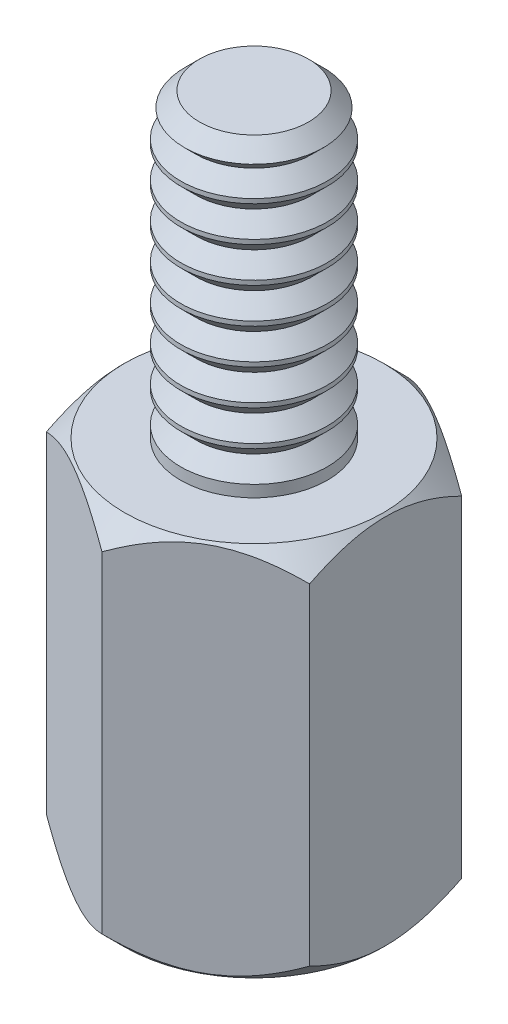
from build123d import *

# Parameters (mm, degrees)
BOSS_EXTRU_1_DEPTH      = 10
ESQUISSE3_R             = 1.95
BOSS_EXTRU_2_DEPTH      = 8
CHANFREIN1_SIZE         = 0.5
ESQUISSE5_R             = 1.95
ENL_V_MAT_EXTRU_1_DEPTH = 9


with BuildPart() as part:
    # Esquisse1 → Boss.-Extru.1 (new body)
    with BuildSketch(Plane(origin=(0, 0, 0), x_dir=(1, 0, 0), z_dir=(0, 1, 0))):
        Polygon((0, 4.041451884), (-3.5, 2.020725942), (-3.5, -2.020725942), (0, -4.041451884), (3.5, -2.020725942), (3.5, 2.020725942), align=None)
    extrude(amount=BOSS_EXTRU_1_DEPTH)

    # Esquisse2 → Enl_vement de mati_re-R_volution1 (revolve, cut)
    with BuildSketch(Plane(origin=(0, 0, 0), x_dir=(0, 0, -1), z_dir=(1, 0, 0)), mode=Mode.PRIVATE) as enl_vement_de_mati_re_r_volution1_sk:
        Polygon((-4.041451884, 9.4), (-3.441451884, 10), (-4.041451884, 10), align=None)
        Polygon((-4.041451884, 0), (-4.041451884, 0.6), (-3.441451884, 0), align=None)
    revolve(enl_vement_de_mati_re_r_volution1_sk.sketch.rotate(Axis((0, 10, 0), (0, -1, 0)), 180), axis=Axis((0, 10, 0), (0, -1, 0)), mode=Mode.SUBTRACT)

    # Esquisse3 → Boss.-Extru.2 (add)
    with BuildSketch(Plane(origin=(0, 10, 0), x_dir=(1, 0, 0), z_dir=(0, 1, 0))):
        with Locations(Location((0, 0, 0), (0, 0, 270))):
            Circle(ESQUISSE3_R)
    extrude(amount=BOSS_EXTRU_2_DEPTH)

    # Chanfrein1
    chanfrein1_edges = [part.edges().sort_by_distance(p)[0] for p in [
        (0, 18, -1.95),
    ]]
    chamfer(chanfrein1_edges, length=CHANFREIN1_SIZE)

    # Esquisse4 → Enl_vement de mati_re-R_volution2 (revolve, cut)
    with BuildSketch(Plane(origin=(0, 0, 0), x_dir=(0, 0, -1), z_dir=(1, 0, 0)), mode=Mode.PRIVATE) as enl_vement_de_mati_re_r_volution2_sk:
        Polygon((-1.95, 11.130243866), (-1.95, 10.31), (-1.539878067, 10.720121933), align=None)
        Polygon((-1.95, 12.070243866), (-1.95, 11.25), (-1.539878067, 11.660121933), align=None)
        Polygon((-1.95, 13.010243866), (-1.95, 12.19), (-1.539878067, 12.600121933), align=None)
        Polygon((-1.95, 13.950243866), (-1.95, 13.13), (-1.539878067, 13.540121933), align=None)
        Polygon((-1.95, 14.890243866), (-1.95, 14.07), (-1.539878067, 14.480121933), align=None)
        Polygon((-1.95, 15.830243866), (-1.95, 15.01), (-1.539878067, 15.420121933), align=None)
        Polygon((-1.95, 16.770243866), (-1.95, 15.95), (-1.539878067, 16.360121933), align=None)
        Polygon((-1.95, 17.710243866), (-1.95, 16.89), (-1.539878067, 17.300121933), align=None)
    revolve(enl_vement_de_mati_re_r_volution2_sk.sketch.rotate(Axis((0, 10, 0), (0, 1, 0)), 180), axis=Axis((0, 10, 0), (0, 1, 0)), mode=Mode.SUBTRACT)

    # Esquisse5 → Enl_v. mat.-Extru.1 (cut)
    with BuildSketch(Plane(origin=(0, 0, 0), x_dir=(-1, 0, 0), z_dir=(0, -1, 0))):
        with Locations(Location((0, 0, 0), (0, 0, 90))):
            Circle(ESQUISSE5_R)
    extrude(amount=-ENL_V_MAT_EXTRU_1_DEPTH, mode=Mode.SUBTRACT)


solid = part.part
